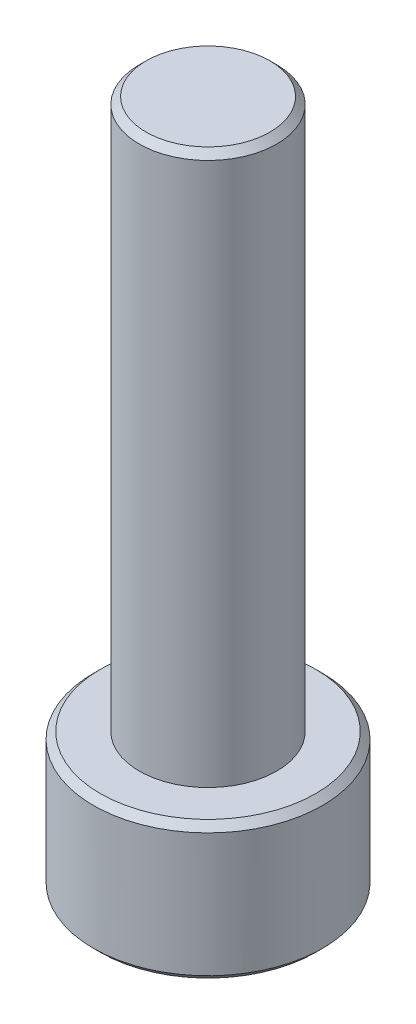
from build123d import *

# Parameters (mm, degrees)
SKETCH1_R           = 5
BOSS_EXTRUDE1_DEPTH = 6
SKETCH2_R           = 3
BOSS_EXTRUDE2_DEPTH = 24
CHAMFER1_SIZE       = 0.3
CHAMFER2_SIZE       = 0.3
CUT_EXTRUDE1_DEPTH  = 3


with BuildPart() as part:
    # Sketch1 → Boss-Extrude1 (new body)
    with BuildSketch(Plane(origin=(0, 0, 0), x_dir=(1, 0, 0), z_dir=(0, 1, 0))):
        with Locations(Location((0, 0, 0), (0, 0, 270))):
            Circle(SKETCH1_R)
    extrude(amount=BOSS_EXTRUDE1_DEPTH)

    # Sketch2 → Boss-Extrude2 (add)
    with BuildSketch(Plane(origin=(0, 6, 0), x_dir=(1, 0, 0), z_dir=(0, 1, 0))):
        with Locations(Location((0, 0, 0), (0, 0, 270))):
            Circle(SKETCH2_R)
    extrude(amount=BOSS_EXTRUDE2_DEPTH)

    # Chamfer1
    chamfer1_edges = [part.edges().sort_by_distance(p)[0] for p in [
        (0, 0, -5),
        (0, 6, -5),
    ]]
    chamfer(chamfer1_edges, length=CHAMFER1_SIZE)

    # Chamfer2
    chamfer2_edges = [part.edges().sort_by_distance(p)[0] for p in [
        (0, 30, -3),
    ]]
    chamfer(chamfer2_edges, length=CHAMFER2_SIZE)

    # Sketch3 → Cut-Extrude1 (cut)
    with BuildSketch(Plane.XZ):
        Polygon((2.886751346, 0), (1.443375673, 2.5), (-1.443375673, 2.5), (-2.886751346, 0), (-1.443375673, -2.5), (1.443375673, -2.5), align=None)
    extrude(amount=-CUT_EXTRUDE1_DEPTH, mode=Mode.SUBTRACT)


solid = part.part
